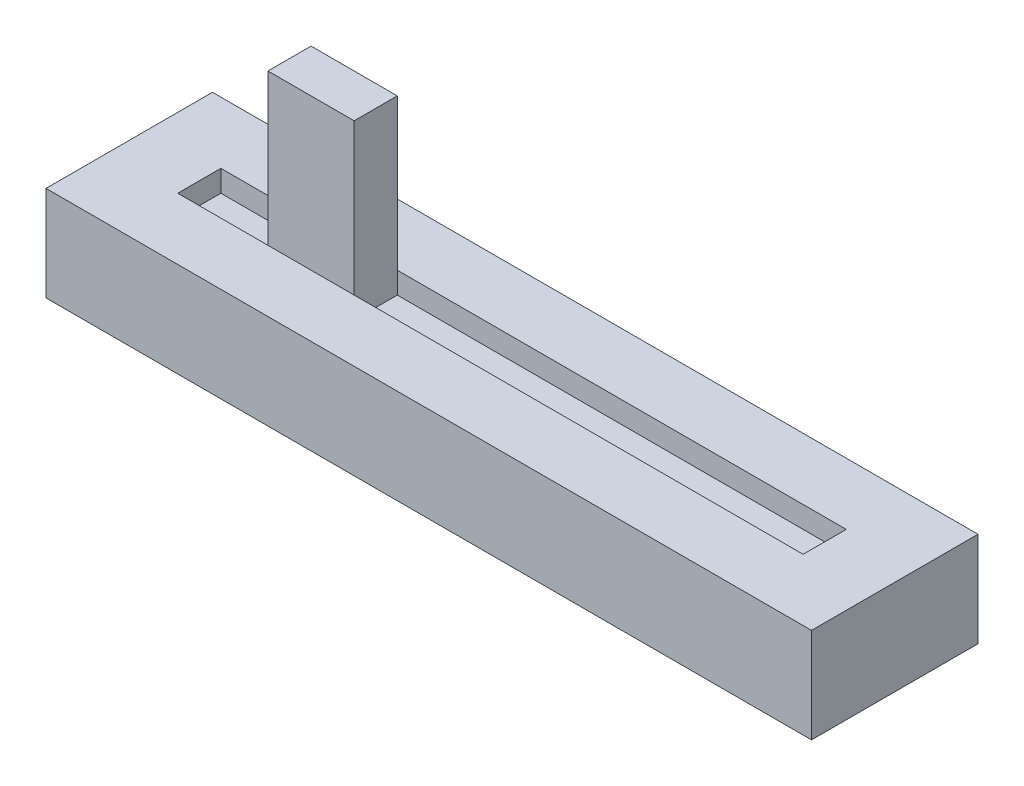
ISO-10303-21;
HEADER;
FILE_DESCRIPTION(('STEP AP214'),'2;1');
FILE_NAME('part.step','',(''),(''),'','','');
FILE_SCHEMA(('AUTOMOTIVE_DESIGN { 1 0 10303 214 1 1 1 1 }'));
ENDSEC;
DATA;
#1=APPLICATION_CONTEXT('core data for automotive mechanical design processes');
#2=APPLICATION_PROTOCOL_DEFINITION('international standard','automotive_design',2000,#1);
#3=PRODUCT_CONTEXT('',#1,'mechanical');
#4=PRODUCT('Part','Part','',(#3));
#5=PRODUCT_RELATED_PRODUCT_CATEGORY('part','',(#4));
#6=PRODUCT_DEFINITION_FORMATION('','',#4);
#7=PRODUCT_DEFINITION_CONTEXT('part definition',#1,'design');
#8=PRODUCT_DEFINITION('design','',#6,#7);
#9=PRODUCT_DEFINITION_SHAPE('','',#8);
#10=(LENGTH_UNIT() NAMED_UNIT(*) SI_UNIT(.MILLI.,.METRE.));
#11=(NAMED_UNIT(*) PLANE_ANGLE_UNIT() SI_UNIT($,.RADIAN.));
#12=(NAMED_UNIT(*) SI_UNIT($,.STERADIAN.) SOLID_ANGLE_UNIT());
#13=UNCERTAINTY_MEASURE_WITH_UNIT(LENGTH_MEASURE(1.E-05),#10,'distance_accuracy_value','');
#14=(GEOMETRIC_REPRESENTATION_CONTEXT(3) GLOBAL_UNCERTAINTY_ASSIGNED_CONTEXT((#13)) GLOBAL_UNIT_ASSIGNED_CONTEXT((#10,
#11,#12)) REPRESENTATION_CONTEXT('',''));
#15=CARTESIAN_POINT('',(0.,0.,0.));
#16=DIRECTION('',(0.,0.,1.));
#17=DIRECTION('',(1.,0.,0.));
#18=AXIS2_PLACEMENT_3D('',#15,#16,#17);
#19=CARTESIAN_POINT('',(18.415,4.318,-1.27));
#20=DIRECTION('',(0.,0.,-1.));
#21=DIRECTION('',(-1.,0.,0.));
#22=AXIS2_PLACEMENT_3D('',#19,#20,#21);
#23=PLANE('',#22);
#24=DIRECTION('',(0.,-1.,0.));
#25=VECTOR('',#24,1.);
#26=CARTESIAN_POINT('',(-8.02575434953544,14.478,-1.27));
#27=LINE('',#26,#25);
#28=CARTESIAN_POINT('',(-8.02575434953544,5.588,-1.27));
#29=VERTEX_POINT('',#28);
#30=CARTESIAN_POINT('',(-8.02575434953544,4.318,-1.27));
#31=VERTEX_POINT('',#30);
#32=EDGE_CURVE('E159',#29,#31,#27,.T.);
#33=ORIENTED_EDGE('',*,*,#32,.T.);
#34=DIRECTION('',(-1.,0.,0.));
#35=VECTOR('',#34,1.);
#36=CARTESIAN_POINT('',(18.415,4.318,-1.27));
#37=LINE('',#36,#35);
#38=CARTESIAN_POINT('',(18.415,4.318,-1.27));
#39=VERTEX_POINT('',#38);
#40=EDGE_CURVE('E181',#39,#31,#37,.T.);
#41=ORIENTED_EDGE('',*,*,#40,.F.);
#42=DIRECTION('',(0.,1.,0.));
#43=VECTOR('',#42,1.);
#44=CARTESIAN_POINT('',(18.415,4.318,-1.27));
#45=LINE('',#44,#43);
#46=CARTESIAN_POINT('',(18.415,5.588,-1.27));
#47=VERTEX_POINT('',#46);
#48=EDGE_CURVE('E199',#39,#47,#45,.T.);
#49=ORIENTED_EDGE('',*,*,#48,.T.);
#50=DIRECTION('',(-1.,0.,0.));
#51=VECTOR('',#50,1.);
#52=CARTESIAN_POINT('',(18.415,5.588,-1.27));
#53=LINE('',#52,#51);
#54=EDGE_CURVE('E173',#47,#29,#53,.T.);
#55=ORIENTED_EDGE('',*,*,#54,.T.);
#56=EDGE_LOOP('',(#33,#41,#49,#55));
#57=FACE_BOUND('',#56,.T.);
#58=ADVANCED_FACE('F33',(#57),#23,.F.);
#59=DIRECTION('',(0.,-1.,0.));
#60=VECTOR('',#59,1.);
#61=CARTESIAN_POINT('',(-13.1057543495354,14.478,-1.27));
#62=LINE('',#61,#60);
#63=CARTESIAN_POINT('',(-13.1057543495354,5.588,-1.27));
#64=VERTEX_POINT('',#63);
#65=CARTESIAN_POINT('',(-13.1057543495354,4.318,-1.27));
#66=VERTEX_POINT('',#65);
#67=EDGE_CURVE('E48',#64,#66,#62,.T.);
#68=ORIENTED_EDGE('',*,*,#67,.F.);
#69=CARTESIAN_POINT('',(-18.415,5.588,-1.27));
#70=VERTEX_POINT('',#69);
#71=EDGE_CURVE('E193',#64,#70,#53,.T.);
#72=ORIENTED_EDGE('',*,*,#71,.T.);
#73=DIRECTION('',(0.,1.,0.));
#74=VECTOR('',#73,1.);
#75=CARTESIAN_POINT('',(-18.415,4.318,-1.27));
#76=LINE('',#75,#74);
#77=CARTESIAN_POINT('',(-18.415,4.318,-1.27));
#78=VERTEX_POINT('',#77);
#79=EDGE_CURVE('E196',#78,#70,#76,.T.);
#80=ORIENTED_EDGE('',*,*,#79,.F.);
#81=EDGE_CURVE('E180',#66,#78,#37,.T.);
#82=ORIENTED_EDGE('',*,*,#81,.F.);
#83=EDGE_LOOP('',(#68,#72,#80,#82));
#84=FACE_BOUND('',#83,.T.);
#85=ADVANCED_FACE('F257',(#84),#23,.F.);
#86=CARTESIAN_POINT('',(18.415,4.318,1.27));
#87=DIRECTION('',(0.,0.,1.));
#88=DIRECTION('',(1.,0.,0.));
#89=AXIS2_PLACEMENT_3D('',#86,#87,#88);
#90=PLANE('',#89);
#91=DIRECTION('',(0.,-1.,0.));
#92=VECTOR('',#91,1.);
#93=CARTESIAN_POINT('',(-8.02575434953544,14.478,1.27));
#94=LINE('',#93,#92);
#95=CARTESIAN_POINT('',(-8.02575434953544,5.588,1.27));
#96=VERTEX_POINT('',#95);
#97=CARTESIAN_POINT('',(-8.02575434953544,4.318,1.27));
#98=VERTEX_POINT('',#97);
#99=EDGE_CURVE('E424',#96,#98,#94,.T.);
#100=ORIENTED_EDGE('',*,*,#99,.F.);
#101=DIRECTION('',(1.,0.,0.));
#102=VECTOR('',#101,1.);
#103=CARTESIAN_POINT('',(18.415,5.588,1.27));
#104=LINE('',#103,#102);
#105=CARTESIAN_POINT('',(18.415,5.588,1.27));
#106=VERTEX_POINT('',#105);
#107=EDGE_CURVE('E186',#96,#106,#104,.T.);
#108=ORIENTED_EDGE('',*,*,#107,.T.);
#109=DIRECTION('',(0.,1.,0.));
#110=VECTOR('',#109,1.);
#111=CARTESIAN_POINT('',(18.415,4.318,1.27));
#112=LINE('',#111,#110);
#113=CARTESIAN_POINT('',(18.415,4.318,1.27));
#114=VERTEX_POINT('',#113);
#115=EDGE_CURVE('E201',#114,#106,#112,.T.);
#116=ORIENTED_EDGE('',*,*,#115,.F.);
#117=DIRECTION('',(1.,0.,0.));
#118=VECTOR('',#117,1.);
#119=CARTESIAN_POINT('',(18.415,4.318,1.27));
#120=LINE('',#119,#118);
#121=EDGE_CURVE('E172',#98,#114,#120,.T.);
#122=ORIENTED_EDGE('',*,*,#121,.F.);
#123=EDGE_LOOP('',(#100,#108,#116,#122));
#124=FACE_BOUND('',#123,.T.);
#125=ADVANCED_FACE('F263',(#124),#90,.F.);
#126=DIRECTION('',(0.,-1.,0.));
#127=VECTOR('',#126,1.);
#128=CARTESIAN_POINT('',(-13.1057543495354,14.478,1.27));
#129=LINE('',#128,#127);
#130=CARTESIAN_POINT('',(-13.1057543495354,5.588,1.27));
#131=VERTEX_POINT('',#130);
#132=CARTESIAN_POINT('',(-13.1057543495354,4.318,1.27));
#133=VERTEX_POINT('',#132);
#134=EDGE_CURVE('E419',#131,#133,#129,.T.);
#135=ORIENTED_EDGE('',*,*,#134,.T.);
#136=CARTESIAN_POINT('',(-18.415,4.318,1.27));
#137=VERTEX_POINT('',#136);
#138=EDGE_CURVE('E174',#137,#133,#120,.T.);
#139=ORIENTED_EDGE('',*,*,#138,.F.);
#140=DIRECTION('',(0.,1.,0.));
#141=VECTOR('',#140,1.);
#142=CARTESIAN_POINT('',(-18.415,4.318,1.27));
#143=LINE('',#142,#141);
#144=CARTESIAN_POINT('',(-18.415,5.588,1.27));
#145=VERTEX_POINT('',#144);
#146=EDGE_CURVE('E184',#137,#145,#143,.T.);
#147=ORIENTED_EDGE('',*,*,#146,.T.);
#148=EDGE_CURVE('E187',#145,#131,#104,.T.);
#149=ORIENTED_EDGE('',*,*,#148,.T.);
#150=EDGE_LOOP('',(#135,#139,#147,#149));
#151=FACE_BOUND('',#150,.T.);
#152=ADVANCED_FACE('F276',(#151),#90,.F.);
#153=CARTESIAN_POINT('',(0.,4.318,0.));
#154=DIRECTION('',(0.,1.,0.));
#155=DIRECTION('',(0.,0.,1.));
#156=AXIS2_PLACEMENT_3D('',#153,#154,#155);
#157=PLANE('',#156);
#158=ORIENTED_EDGE('',*,*,#40,.T.);
#159=DIRECTION('',(0.,0.,-1.));
#160=VECTOR('',#159,1.);
#161=CARTESIAN_POINT('',(-8.02575434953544,4.318,-1.27));
#162=LINE('',#161,#160);
#163=EDGE_CURVE('E428',#98,#31,#162,.T.);
#164=ORIENTED_EDGE('',*,*,#163,.F.);
#165=ORIENTED_EDGE('',*,*,#121,.T.);
#166=DIRECTION('',(0.,0.,-1.));
#167=VECTOR('',#166,1.);
#168=CARTESIAN_POINT('',(18.415,4.318,1.27));
#169=LINE('',#168,#167);
#170=EDGE_CURVE('E177',#114,#39,#169,.T.);
#171=ORIENTED_EDGE('',*,*,#170,.T.);
#172=EDGE_LOOP('',(#158,#164,#165,#171));
#173=FACE_BOUND('',#172,.T.);
#174=ADVANCED_FACE('F267',(#173),#157,.T.);
#175=ORIENTED_EDGE('',*,*,#138,.T.);
#176=DIRECTION('',(0.,0.,1.));
#177=VECTOR('',#176,1.);
#178=CARTESIAN_POINT('',(-13.1057543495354,4.318,-1.27));
#179=LINE('',#178,#177);
#180=EDGE_CURVE('E155',#66,#133,#179,.T.);
#181=ORIENTED_EDGE('',*,*,#180,.F.);
#182=ORIENTED_EDGE('',*,*,#81,.T.);
#183=DIRECTION('',(0.,0.,1.));
#184=VECTOR('',#183,1.);
#185=CARTESIAN_POINT('',(-18.415,4.318,1.27));
#186=LINE('',#185,#184);
#187=EDGE_CURVE('E169',#78,#137,#186,.T.);
#188=ORIENTED_EDGE('',*,*,#187,.T.);
#189=EDGE_LOOP('',(#175,#181,#182,#188));
#190=FACE_BOUND('',#189,.T.);
#191=ADVANCED_FACE('F255',(#190),#157,.T.);
#192=CARTESIAN_POINT('',(-22.5425,5.588,4.9022));
#193=DIRECTION('',(1.,0.,0.));
#194=DIRECTION('',(0.,0.,-1.));
#195=AXIS2_PLACEMENT_3D('',#192,#193,#194);
#196=PLANE('',#195);
#197=DIRECTION('',(0.,0.,1.));
#198=VECTOR('',#197,1.);
#199=CARTESIAN_POINT('',(-22.5425,0.,4.9022));
#200=LINE('',#199,#198);
#201=CARTESIAN_POINT('',(-22.5425,0.,-4.9022));
#202=VERTEX_POINT('',#201);
#203=CARTESIAN_POINT('',(-22.5425,0.,4.9022));
#204=VERTEX_POINT('',#203);
#205=EDGE_CURVE('E198',#202,#204,#200,.T.);
#206=ORIENTED_EDGE('',*,*,#205,.T.);
#207=DIRECTION('',(0.,-1.,0.));
#208=VECTOR('',#207,1.);
#209=CARTESIAN_POINT('',(-22.5425,5.588,4.9022));
#210=LINE('',#209,#208);
#211=CARTESIAN_POINT('',(-22.5425,5.588,4.9022));
#212=VERTEX_POINT('',#211);
#213=EDGE_CURVE('E11',#212,#204,#210,.T.);
#214=ORIENTED_EDGE('',*,*,#213,.F.);
#215=DIRECTION('',(0.,0.,1.));
#216=VECTOR('',#215,1.);
#217=CARTESIAN_POINT('',(-22.5425,5.588,4.9022));
#218=LINE('',#217,#216);
#219=CARTESIAN_POINT('',(-22.5425,5.588,-4.9022));
#220=VERTEX_POINT('',#219);
#221=EDGE_CURVE('E205',#220,#212,#218,.T.);
#222=ORIENTED_EDGE('',*,*,#221,.F.);
#223=DIRECTION('',(0.,-1.,0.));
#224=VECTOR('',#223,1.);
#225=CARTESIAN_POINT('',(-22.5425,5.588,-4.9022));
#226=LINE('',#225,#224);
#227=EDGE_CURVE('E215',#220,#202,#226,.T.);
#228=ORIENTED_EDGE('',*,*,#227,.T.);
#229=EDGE_LOOP('',(#206,#214,#222,#228));
#230=FACE_BOUND('',#229,.T.);
#231=ADVANCED_FACE('F35',(#230),#196,.F.);
#232=CARTESIAN_POINT('',(22.5425,5.588,4.9022));
#233=DIRECTION('',(0.,0.,-1.));
#234=DIRECTION('',(-1.,0.,0.));
#235=AXIS2_PLACEMENT_3D('',#232,#233,#234);
#236=PLANE('',#235);
#237=DIRECTION('',(1.,0.,0.));
#238=VECTOR('',#237,1.);
#239=CARTESIAN_POINT('',(22.5425,0.,4.9022));
#240=LINE('',#239,#238);
#241=CARTESIAN_POINT('',(22.5425,0.,4.9022));
#242=VERTEX_POINT('',#241);
#243=EDGE_CURVE('E218',#204,#242,#240,.T.);
#244=ORIENTED_EDGE('',*,*,#243,.T.);
#245=DIRECTION('',(0.,-1.,0.));
#246=VECTOR('',#245,1.);
#247=CARTESIAN_POINT('',(22.5425,5.588,4.9022));
#248=LINE('',#247,#246);
#249=CARTESIAN_POINT('',(22.5425,5.588,4.9022));
#250=VERTEX_POINT('',#249);
#251=EDGE_CURVE('E41',#250,#242,#248,.T.);
#252=ORIENTED_EDGE('',*,*,#251,.F.);
#253=DIRECTION('',(1.,0.,0.));
#254=VECTOR('',#253,1.);
#255=CARTESIAN_POINT('',(22.5425,5.588,4.9022));
#256=LINE('',#255,#254);
#257=EDGE_CURVE('E208',#212,#250,#256,.T.);
#258=ORIENTED_EDGE('',*,*,#257,.F.);
#259=ORIENTED_EDGE('',*,*,#213,.T.);
#260=EDGE_LOOP('',(#244,#252,#258,#259));
#261=FACE_BOUND('',#260,.T.);
#262=ADVANCED_FACE('F248',(#261),#236,.F.);
#263=CARTESIAN_POINT('',(22.5425,5.588,4.9022));
#264=DIRECTION('',(-1.,0.,0.));
#265=DIRECTION('',(0.,0.,1.));
#266=AXIS2_PLACEMENT_3D('',#263,#264,#265);
#267=PLANE('',#266);
#268=DIRECTION('',(0.,0.,-1.));
#269=VECTOR('',#268,1.);
#270=CARTESIAN_POINT('',(22.5425,0.,4.9022));
#271=LINE('',#270,#269);
#272=CARTESIAN_POINT('',(22.5425,0.,-4.9022));
#273=VERTEX_POINT('',#272);
#274=EDGE_CURVE('E220',#242,#273,#271,.T.);
#275=ORIENTED_EDGE('',*,*,#274,.T.);
#276=DIRECTION('',(0.,-1.,0.));
#277=VECTOR('',#276,1.);
#278=CARTESIAN_POINT('',(22.5425,5.588,-4.9022));
#279=LINE('',#278,#277);
#280=CARTESIAN_POINT('',(22.5425,5.588,-4.9022));
#281=VERTEX_POINT('',#280);
#282=EDGE_CURVE('E225',#281,#273,#279,.T.);
#283=ORIENTED_EDGE('',*,*,#282,.F.);
#284=DIRECTION('',(0.,0.,-1.));
#285=VECTOR('',#284,1.);
#286=CARTESIAN_POINT('',(22.5425,5.588,4.9022));
#287=LINE('',#286,#285);
#288=EDGE_CURVE('E211',#250,#281,#287,.T.);
#289=ORIENTED_EDGE('',*,*,#288,.F.);
#290=ORIENTED_EDGE('',*,*,#251,.T.);
#291=EDGE_LOOP('',(#275,#283,#289,#290));
#292=FACE_BOUND('',#291,.T.);
#293=ADVANCED_FACE('F232',(#292),#267,.F.);
#294=CARTESIAN_POINT('',(22.5425,5.588,-4.9022));
#295=DIRECTION('',(0.,0.,1.));
#296=DIRECTION('',(1.,0.,0.));
#297=AXIS2_PLACEMENT_3D('',#294,#295,#296);
#298=PLANE('',#297);
#299=DIRECTION('',(-1.,0.,0.));
#300=VECTOR('',#299,1.);
#301=CARTESIAN_POINT('',(22.5425,0.,-4.9022));
#302=LINE('',#301,#300);
#303=EDGE_CURVE('E209',#273,#202,#302,.T.);
#304=ORIENTED_EDGE('',*,*,#303,.T.);
#305=ORIENTED_EDGE('',*,*,#227,.F.);
#306=DIRECTION('',(-1.,0.,0.));
#307=VECTOR('',#306,1.);
#308=CARTESIAN_POINT('',(22.5425,5.588,-4.9022));
#309=LINE('',#308,#307);
#310=EDGE_CURVE('E213',#281,#220,#309,.T.);
#311=ORIENTED_EDGE('',*,*,#310,.F.);
#312=ORIENTED_EDGE('',*,*,#282,.T.);
#313=EDGE_LOOP('',(#304,#305,#311,#312));
#314=FACE_BOUND('',#313,.T.);
#315=ADVANCED_FACE('F241',(#314),#298,.F.);
#316=CARTESIAN_POINT('',(0.,5.588,0.));
#317=DIRECTION('',(0.,1.,0.));
#318=DIRECTION('',(0.,0.,1.));
#319=AXIS2_PLACEMENT_3D('',#316,#317,#318);
#320=PLANE('',#319);
#321=DIRECTION('',(0.,0.,1.));
#322=VECTOR('',#321,1.);
#323=CARTESIAN_POINT('',(-18.415,5.588,1.27));
#324=LINE('',#323,#322);
#325=EDGE_CURVE('E56',#70,#145,#324,.T.);
#326=ORIENTED_EDGE('',*,*,#325,.F.);
#327=ORIENTED_EDGE('',*,*,#71,.F.);
#328=DIRECTION('',(1.,0.,0.));
#329=VECTOR('',#328,1.);
#330=CARTESIAN_POINT('',(0.,5.588,-1.27));
#331=LINE('',#330,#329);
#332=EDGE_CURVE('E163',#64,#29,#331,.T.);
#333=ORIENTED_EDGE('',*,*,#332,.T.);
#334=ORIENTED_EDGE('',*,*,#54,.F.);
#335=DIRECTION('',(0.,0.,-1.));
#336=VECTOR('',#335,1.);
#337=CARTESIAN_POINT('',(18.415,5.588,1.27));
#338=LINE('',#337,#336);
#339=EDGE_CURVE('E190',#106,#47,#338,.T.);
#340=ORIENTED_EDGE('',*,*,#339,.F.);
#341=ORIENTED_EDGE('',*,*,#107,.F.);
#342=DIRECTION('',(-1.,0.,0.));
#343=VECTOR('',#342,1.);
#344=CARTESIAN_POINT('',(0.,5.588,1.27));
#345=LINE('',#344,#343);
#346=EDGE_CURVE('E160',#96,#131,#345,.T.);
#347=ORIENTED_EDGE('',*,*,#346,.T.);
#348=ORIENTED_EDGE('',*,*,#148,.F.);
#349=EDGE_LOOP('',(#326,#327,#333,#334,#340,#341,#347,#348));
#350=FACE_BOUND('',#349,.T.);
#351=ORIENTED_EDGE('',*,*,#221,.T.);
#352=ORIENTED_EDGE('',*,*,#257,.T.);
#353=ORIENTED_EDGE('',*,*,#288,.T.);
#354=ORIENTED_EDGE('',*,*,#310,.T.);
#355=EDGE_LOOP('',(#351,#352,#353,#354));
#356=FACE_BOUND('',#355,.T.);
#357=ADVANCED_FACE('F247',(#350,#356),#320,.T.);
#358=CARTESIAN_POINT('',(0.,0.,0.));
#359=DIRECTION('',(0.,1.,0.));
#360=DIRECTION('',(0.,0.,1.));
#361=AXIS2_PLACEMENT_3D('',#358,#359,#360);
#362=PLANE('',#361);
#363=ORIENTED_EDGE('',*,*,#205,.F.);
#364=ORIENTED_EDGE('',*,*,#303,.F.);
#365=ORIENTED_EDGE('',*,*,#274,.F.);
#366=ORIENTED_EDGE('',*,*,#243,.F.);
#367=EDGE_LOOP('',(#363,#364,#365,#366));
#368=FACE_BOUND('',#367,.T.);
#369=ADVANCED_FACE('F238',(#368),#362,.F.);
#370=CARTESIAN_POINT('',(-18.415,4.318,1.27));
#371=DIRECTION('',(-1.,0.,0.));
#372=DIRECTION('',(0.,0.,1.));
#373=AXIS2_PLACEMENT_3D('',#370,#371,#372);
#374=PLANE('',#373);
#375=ORIENTED_EDGE('',*,*,#325,.T.);
#376=ORIENTED_EDGE('',*,*,#146,.F.);
#377=ORIENTED_EDGE('',*,*,#187,.F.);
#378=ORIENTED_EDGE('',*,*,#79,.T.);
#379=EDGE_LOOP('',(#375,#376,#377,#378));
#380=FACE_BOUND('',#379,.T.);
#381=ADVANCED_FACE('F272',(#380),#374,.F.);
#382=CARTESIAN_POINT('',(18.415,4.318,1.27));
#383=DIRECTION('',(1.,0.,0.));
#384=DIRECTION('',(0.,0.,-1.));
#385=AXIS2_PLACEMENT_3D('',#382,#383,#384);
#386=PLANE('',#385);
#387=ORIENTED_EDGE('',*,*,#339,.T.);
#388=ORIENTED_EDGE('',*,*,#48,.F.);
#389=ORIENTED_EDGE('',*,*,#170,.F.);
#390=ORIENTED_EDGE('',*,*,#115,.T.);
#391=EDGE_LOOP('',(#387,#388,#389,#390));
#392=FACE_BOUND('',#391,.T.);
#393=ADVANCED_FACE('F269',(#392),#386,.F.);
#394=CARTESIAN_POINT('',(-8.02575434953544,14.478,-1.27));
#395=DIRECTION('',(-1.,0.,0.));
#396=DIRECTION('',(0.,0.,1.));
#397=AXIS2_PLACEMENT_3D('',#394,#395,#396);
#398=PLANE('',#397);
#399=ORIENTED_EDGE('',*,*,#163,.T.);
#400=ORIENTED_EDGE('',*,*,#32,.F.);
#401=CARTESIAN_POINT('',(-8.02575434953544,14.478,-1.27));
#402=VERTEX_POINT('',#401);
#403=EDGE_CURVE('E140',#402,#29,#27,.T.);
#404=ORIENTED_EDGE('',*,*,#403,.F.);
#405=DIRECTION('',(0.,0.,-1.));
#406=VECTOR('',#405,1.);
#407=CARTESIAN_POINT('',(-8.02575434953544,14.478,-1.27));
#408=LINE('',#407,#406);
#409=CARTESIAN_POINT('',(-8.02575434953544,14.478,1.27));
#410=VERTEX_POINT('',#409);
#411=EDGE_CURVE('E146',#410,#402,#408,.T.);
#412=ORIENTED_EDGE('',*,*,#411,.F.);
#413=EDGE_CURVE('E423',#410,#96,#94,.T.);
#414=ORIENTED_EDGE('',*,*,#413,.T.);
#415=ORIENTED_EDGE('',*,*,#99,.T.);
#416=EDGE_LOOP('',(#399,#400,#404,#412,#414,#415));
#417=FACE_BOUND('',#416,.T.);
#418=ADVANCED_FACE('F157',(#417),#398,.F.);
#419=CARTESIAN_POINT('',(-13.1057543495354,14.478,-1.27));
#420=DIRECTION('',(0.,0.,1.));
#421=DIRECTION('',(1.,0.,0.));
#422=AXIS2_PLACEMENT_3D('',#419,#420,#421);
#423=PLANE('',#422);
#424=ORIENTED_EDGE('',*,*,#332,.F.);
#425=CARTESIAN_POINT('',(-13.1057543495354,14.478,-1.27));
#426=VERTEX_POINT('',#425);
#427=EDGE_CURVE('E142',#426,#64,#62,.T.);
#428=ORIENTED_EDGE('',*,*,#427,.F.);
#429=DIRECTION('',(-1.,0.,0.));
#430=VECTOR('',#429,1.);
#431=CARTESIAN_POINT('',(-13.1057543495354,14.478,-1.27));
#432=LINE('',#431,#430);
#433=EDGE_CURVE('E136',#402,#426,#432,.T.);
#434=ORIENTED_EDGE('',*,*,#433,.F.);
#435=ORIENTED_EDGE('',*,*,#403,.T.);
#436=EDGE_LOOP('',(#424,#428,#434,#435));
#437=FACE_BOUND('',#436,.T.);
#438=ADVANCED_FACE('F138',(#437),#423,.F.);
#439=CARTESIAN_POINT('',(-13.1057543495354,14.478,-1.27));
#440=DIRECTION('',(1.,0.,0.));
#441=DIRECTION('',(0.,0.,-1.));
#442=AXIS2_PLACEMENT_3D('',#439,#440,#441);
#443=PLANE('',#442);
#444=ORIENTED_EDGE('',*,*,#180,.T.);
#445=ORIENTED_EDGE('',*,*,#134,.F.);
#446=CARTESIAN_POINT('',(-13.1057543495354,14.478,1.27));
#447=VERTEX_POINT('',#446);
#448=EDGE_CURVE('E422',#447,#131,#129,.T.);
#449=ORIENTED_EDGE('',*,*,#448,.F.);
#450=DIRECTION('',(0.,0.,1.));
#451=VECTOR('',#450,1.);
#452=CARTESIAN_POINT('',(-13.1057543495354,14.478,-1.27));
#453=LINE('',#452,#451);
#454=EDGE_CURVE('E145',#426,#447,#453,.T.);
#455=ORIENTED_EDGE('',*,*,#454,.F.);
#456=ORIENTED_EDGE('',*,*,#427,.T.);
#457=ORIENTED_EDGE('',*,*,#67,.T.);
#458=EDGE_LOOP('',(#444,#445,#449,#455,#456,#457));
#459=FACE_BOUND('',#458,.T.);
#460=ADVANCED_FACE('F318',(#459),#443,.F.);
#461=CARTESIAN_POINT('',(-13.1057543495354,14.478,1.27));
#462=DIRECTION('',(0.,0.,-1.));
#463=DIRECTION('',(-1.,0.,0.));
#464=AXIS2_PLACEMENT_3D('',#461,#462,#463);
#465=PLANE('',#464);
#466=ORIENTED_EDGE('',*,*,#346,.F.);
#467=ORIENTED_EDGE('',*,*,#413,.F.);
#468=DIRECTION('',(1.,0.,0.));
#469=VECTOR('',#468,1.);
#470=CARTESIAN_POINT('',(-13.1057543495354,14.478,1.27));
#471=LINE('',#470,#469);
#472=EDGE_CURVE('E151',#447,#410,#471,.T.);
#473=ORIENTED_EDGE('',*,*,#472,.F.);
#474=ORIENTED_EDGE('',*,*,#448,.T.);
#475=EDGE_LOOP('',(#466,#467,#473,#474));
#476=FACE_BOUND('',#475,.T.);
#477=ADVANCED_FACE('F325',(#476),#465,.F.);
#478=CARTESIAN_POINT('',(0.,14.478,0.));
#479=DIRECTION('',(0.,1.,0.));
#480=DIRECTION('',(0.,0.,1.));
#481=AXIS2_PLACEMENT_3D('',#478,#479,#480);
#482=PLANE('',#481);
#483=ORIENTED_EDGE('',*,*,#411,.T.);
#484=ORIENTED_EDGE('',*,*,#433,.T.);
#485=ORIENTED_EDGE('',*,*,#454,.T.);
#486=ORIENTED_EDGE('',*,*,#472,.T.);
#487=EDGE_LOOP('',(#483,#484,#485,#486));
#488=FACE_BOUND('',#487,.T.);
#489=ADVANCED_FACE('F149',(#488),#482,.T.);
#490=CLOSED_SHELL('',(#58,#85,#125,#152,#174,#191,#231,#262,#293,#315,#357,#369,#381,#393,#418,
#438,#460,#477,#489));
#491=MANIFOLD_SOLID_BREP('B2',#490);
#492=ADVANCED_BREP_SHAPE_REPRESENTATION('',(#18,#491),#14);
#493=SHAPE_DEFINITION_REPRESENTATION(#9,#492);
ENDSEC;
END-ISO-10303-21;
